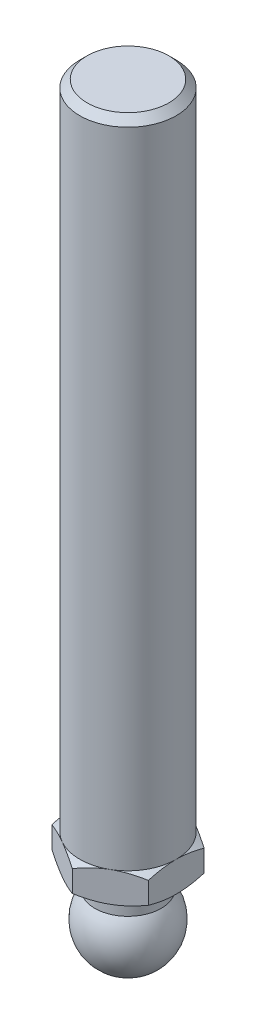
ISO-10303-21;
HEADER;
FILE_DESCRIPTION(('STEP AP214'),'2;1');
FILE_NAME('part.step','',(''),(''),'','','');
FILE_SCHEMA(('AUTOMOTIVE_DESIGN { 1 0 10303 214 1 1 1 1 }'));
ENDSEC;
DATA;
#1=APPLICATION_CONTEXT('core data for automotive mechanical design processes');
#2=APPLICATION_PROTOCOL_DEFINITION('international standard','automotive_design',2000,#1);
#3=PRODUCT_CONTEXT('',#1,'mechanical');
#4=PRODUCT('Part','Part','',(#3));
#5=PRODUCT_RELATED_PRODUCT_CATEGORY('part','',(#4));
#6=PRODUCT_DEFINITION_FORMATION('','',#4);
#7=PRODUCT_DEFINITION_CONTEXT('part definition',#1,'design');
#8=PRODUCT_DEFINITION('design','',#6,#7);
#9=PRODUCT_DEFINITION_SHAPE('','',#8);
#10=(LENGTH_UNIT() NAMED_UNIT(*) SI_UNIT(.MILLI.,.METRE.));
#11=(NAMED_UNIT(*) PLANE_ANGLE_UNIT() SI_UNIT($,.RADIAN.));
#12=(NAMED_UNIT(*) SI_UNIT($,.STERADIAN.) SOLID_ANGLE_UNIT());
#13=UNCERTAINTY_MEASURE_WITH_UNIT(LENGTH_MEASURE(1.E-05),#10,'distance_accuracy_value','');
#14=(GEOMETRIC_REPRESENTATION_CONTEXT(3) GLOBAL_UNCERTAINTY_ASSIGNED_CONTEXT((#13)) GLOBAL_UNIT_ASSIGNED_CONTEXT((#10,
#11,#12)) REPRESENTATION_CONTEXT('',''));
#15=CARTESIAN_POINT('',(0.,0.,0.));
#16=DIRECTION('',(0.,0.,1.));
#17=DIRECTION('',(1.,0.,0.));
#18=AXIS2_PLACEMENT_3D('',#15,#16,#17);
#19=CARTESIAN_POINT('',(0.,19.5,0.));
#20=DIRECTION('',(0.,-1.,0.));
#21=DIRECTION('',(0.,0.,-1.));
#22=AXIS2_PLACEMENT_3D('',#19,#20,#21);
#23=CONICAL_SURFACE('',#22,8.,1.0471975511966);
#24=CARTESIAN_POINT('',(-8.,14.714451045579,14.1889203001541));
#25=CARTESIAN_POINT('',(-8.,14.8842783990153,13.851186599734));
#26=CARTESIAN_POINT('',(-8.,15.0529801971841,13.5128811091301));
#27=CARTESIAN_POINT('',(-8.,15.3875863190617,12.8348638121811));
#28=CARTESIAN_POINT('',(-8.,15.553490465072,12.4951519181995));
#29=CARTESIAN_POINT('',(-8.,15.8822522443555,11.8134403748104));
#30=CARTESIAN_POINT('',(-8.,16.0451033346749,11.4714375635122));
#31=CARTESIAN_POINT('',(-8.,16.3666666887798,10.7854960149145));
#32=CARTESIAN_POINT('',(-8.,16.5253790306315,10.4415573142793));
#33=CARTESIAN_POINT('',(-8.,16.8449502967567,9.7353527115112));
#34=CARTESIAN_POINT('',(-8.,17.0055671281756,9.37297690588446));
#35=CARTESIAN_POINT('',(-8.,17.319773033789,8.64516064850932));
#36=CARTESIAN_POINT('',(-8.,17.4733617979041,8.27972006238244));
#37=CARTESIAN_POINT('',(-8.,17.7714937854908,7.54540420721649));
#38=CARTESIAN_POINT('',(-8.,17.9160424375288,7.17653115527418));
#39=CARTESIAN_POINT('',(-8.,18.1936308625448,6.43449862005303));
#40=CARTESIAN_POINT('',(-8.,18.3266718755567,6.06133960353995));
#41=CARTESIAN_POINT('',(-8.,18.605819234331,5.22677195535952));
#42=CARTESIAN_POINT('',(-8.,18.7482891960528,4.7641292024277));
#43=CARTESIAN_POINT('',(-8.,19.0033463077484,3.83044032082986));
#44=CARTESIAN_POINT('',(-8.,19.115935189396,3.35939468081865));
#45=CARTESIAN_POINT('',(-8.,19.2546281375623,2.65118427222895));
#46=CARTESIAN_POINT('',(-8.,19.2955954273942,2.41690742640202));
#47=CARTESIAN_POINT('',(-8.,19.3670123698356,1.94676929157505));
#48=CARTESIAN_POINT('',(-8.,19.3974635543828,1.7109082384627));
#49=CARTESIAN_POINT('',(-8.,19.4469446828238,1.23805721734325));
#50=CARTESIAN_POINT('',(-8.,19.4659782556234,1.00106763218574));
#51=CARTESIAN_POINT('',(-8.,19.4920206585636,0.526423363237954));
#52=CARTESIAN_POINT('',(-8.,19.499029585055,0.288768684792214));
#53=CARTESIAN_POINT('',(-8.,19.5007883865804,-0.188309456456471));
#54=CARTESIAN_POINT('',(-8.,19.4954490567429,-0.427733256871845));
#55=CARTESIAN_POINT('',(-8.,19.4725128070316,-0.905988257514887));
#56=CARTESIAN_POINT('',(-8.,19.4549157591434,-1.14481945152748));
#57=CARTESIAN_POINT('',(-8.,19.4080408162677,-1.6214163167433));
#58=CARTESIAN_POINT('',(-8.,19.3787584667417,-1.85918154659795));
#59=CARTESIAN_POINT('',(-8.,19.3094074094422,-2.33311174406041));
#60=CARTESIAN_POINT('',(-8.,19.2693385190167,-2.56927668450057));
#61=CARTESIAN_POINT('',(-8.,19.1329562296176,-3.28330816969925));
#62=CARTESIAN_POINT('',(-8.,19.0213579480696,-3.75830022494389));
#63=CARTESIAN_POINT('',(-8.,18.830875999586,-4.46428489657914));
#64=CARTESIAN_POINT('',(-8.,18.7635265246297,-4.69855285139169));
#65=CARTESIAN_POINT('',(-8.,18.6221775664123,-5.16507806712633));
#66=CARTESIAN_POINT('',(-8.,18.5481783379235,-5.39733540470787));
#67=CARTESIAN_POINT('',(-8.,18.345623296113,-6.00705809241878));
#68=CARTESIAN_POINT('',(-8.,18.2123002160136,-6.38293491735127));
#69=CARTESIAN_POINT('',(-8.,17.9338794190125,-7.13030495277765));
#70=CARTESIAN_POINT('',(-8.,17.7887803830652,-7.50179766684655));
#71=CARTESIAN_POINT('',(-8.,17.4893388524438,-8.2412884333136));
#72=CARTESIAN_POINT('',(-8.,17.3349906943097,-8.60928418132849));
#73=CARTESIAN_POINT('',(-8.,17.0191219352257,-9.34215095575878));
#74=CARTESIAN_POINT('',(-8.,16.8576016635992,-9.70702212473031));
#75=CARTESIAN_POINT('',(-8.,16.5362228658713,-10.4179250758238));
#76=CARTESIAN_POINT('',(-8.,16.3766130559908,-10.7640696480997));
#77=CARTESIAN_POINT('',(-8.,16.0531867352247,-11.4543922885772));
#78=CARTESIAN_POINT('',(-8.,15.8893701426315,-11.7985703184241));
#79=CARTESIAN_POINT('',(-8.,15.558638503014,-12.4845836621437));
#80=CARTESIAN_POINT('',(-8.,15.3917303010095,-12.8264222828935));
#81=CARTESIAN_POINT('',(-8.,15.0550779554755,-13.5086735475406));
#82=CARTESIAN_POINT('',(-8.,14.8853339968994,-13.8490862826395));
#83=CARTESIAN_POINT('',(-8.,14.714451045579,-14.1889203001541));
#84=B_SPLINE_CURVE_WITH_KNOTS('',3,(#24,#25,#26,#27,#28,#29,#30,#31,#32,#33,#34,#35,#36,#37,#38,
#39,#40,#41,#42,#43,#44,#45,#46,#47,#48,#49,#50,#51,#52,#53,#54,#55,#56,#57,#58,#59,#60,#61,#62,
#63,#64,#65,#66,#67,#68,#69,#70,#71,#72,#73,#74,#75,#76,#77,#78,#79,#80,#81,#82,#83),
.UNSPECIFIED.,.F.,.F.,(4,2,2,2,2,2,2,2,2,2,2,2,2,2,2,2,2,2,2,2,2,2,2,2,2,2,2,2,2,4),(0.,
1.13409047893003,2.2682527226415,3.40461779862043,4.54096142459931,5.73003075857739,
6.91915250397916,8.1075531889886,9.29582565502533,10.7473798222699,12.1988498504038,
12.9121466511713,13.6253394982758,14.3383055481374,15.0512658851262,15.7693927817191,
16.4875271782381,17.2059355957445,17.9243561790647,19.38648697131,20.1177019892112,
20.8488890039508,22.0450800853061,23.2414053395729,24.4384707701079,25.6354812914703,
26.7789606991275,27.9224623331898,29.063679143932,30.2048218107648),.UNSPECIFIED.);
#85=CARTESIAN_POINT('',(-8.,18.7854688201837,4.61880215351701));
#86=VERTEX_POINT('',#85);
#87=CARTESIAN_POINT('',(-8.,19.5,0.));
#88=VERTEX_POINT('',#87);
#89=EDGE_CURVE('E313',#86,#88,#84,.T.);
#90=ORIENTED_EDGE('',*,*,#89,.F.);
#91=CARTESIAN_POINT('',(0.0002,18.7854021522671,9.23771977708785));
#92=CARTESIAN_POINT('',(-0.175648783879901,18.8440092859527,9.13619343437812));
#93=CARTESIAN_POINT('',(-0.352153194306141,18.8999565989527,9.03428856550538));
#94=CARTESIAN_POINT('',(-0.706595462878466,19.0057989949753,8.82965122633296));
#95=CARTESIAN_POINT('',(-0.884533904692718,19.0556914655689,8.72691841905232));
#96=CARTESIAN_POINT('',(-1.42119823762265,19.1953072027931,8.41707512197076));
#97=CARTESIAN_POINT('',(-1.78204258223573,19.2747188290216,8.20874154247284));
#98=CARTESIAN_POINT('',(-2.32203917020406,19.3678383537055,7.89697436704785));
#99=CARTESIAN_POINT('',(-2.49957818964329,19.3943654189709,7.79447216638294));
#100=CARTESIAN_POINT('',(-2.85545911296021,19.4388468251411,7.58900421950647));
#101=CARTESIAN_POINT('',(-3.03380094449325,19.4568019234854,7.4860385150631));
#102=CARTESIAN_POINT('',(-3.3907916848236,19.4836843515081,7.27992981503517));
#103=CARTESIAN_POINT('',(-3.56944001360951,19.4926219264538,7.17678715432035));
#104=CARTESIAN_POINT('',(-3.92690170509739,19.5012776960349,6.97040655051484));
#105=CARTESIAN_POINT('',(-4.10571506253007,19.5009961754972,6.86716861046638));
#106=CARTESIAN_POINT('',(-4.44001336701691,19.4918549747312,6.67416139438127));
#107=CARTESIAN_POINT('',(-4.59552190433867,19.4841103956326,6.58437849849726));
#108=CARTESIAN_POINT('',(-4.90617476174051,19.4617988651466,6.40502298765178));
#109=CARTESIAN_POINT('',(-5.06131905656,19.4472314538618,6.31545038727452));
#110=CARTESIAN_POINT('',(-5.52615131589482,19.3936393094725,6.04707935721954));
#111=CARTESIAN_POINT('',(-5.83501648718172,19.3447313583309,5.86875596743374));
#112=CARTESIAN_POINT('',(-6.4560232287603,19.2224605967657,5.51021755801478));
#113=CARTESIAN_POINT('',(-6.76808554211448,19.148579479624,5.33004829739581));
#114=CARTESIAN_POINT('',(-7.38755648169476,18.980899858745,4.97239658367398));
#115=CARTESIAN_POINT('',(-7.69497304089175,18.8871407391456,4.79490955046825));
#116=CARTESIAN_POINT('',(-8.0002,18.7854021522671,4.61868668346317));
#117=B_SPLINE_CURVE_WITH_KNOTS('',3,(#91,#92,#93,#94,#95,#96,#97,#98,#99,#100,#101,#102,#103,
#104,#105,#106,#107,#108,#109,#110,#111,#112,#113,#114,#115,#116),.UNSPECIFIED.,.F.,.F.,(4,2,2,
2,2,2,2,2,2,2,2,2,4),(0.,0.633973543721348,1.26821965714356,2.53934712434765,3.15934343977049,
3.77928496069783,4.39852133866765,5.01773858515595,5.55680239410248,6.09590254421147,
7.17487077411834,8.27776850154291,9.37850115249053),.UNSPECIFIED.);
#118=CARTESIAN_POINT('',(-4.,19.5,6.92820323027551));
#119=VERTEX_POINT('',#118);
#120=EDGE_CURVE('E138',#119,#86,#117,.T.);
#121=ORIENTED_EDGE('',*,*,#120,.F.);
#122=CARTESIAN_POINT('',(0.,19.5,0.));
#123=DIRECTION('',(0.,-1.,0.));
#124=DIRECTION('',(0.,0.,-1.));
#125=AXIS2_PLACEMENT_3D('',#122,#123,#124);
#126=CIRCLE('',#125,8.);
#127=EDGE_CURVE('E286',#119,#88,#126,.T.);
#128=ORIENTED_EDGE('',*,*,#127,.T.);
#129=EDGE_LOOP('',(#90,#121,#128));
#130=FACE_BOUND('',#129,.T.);
#131=ADVANCED_FACE('F17',(#130),#23,.T.);
#132=CARTESIAN_POINT('',(-8.,18.7854688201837,-4.61880215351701));
#133=VERTEX_POINT('',#132);
#134=EDGE_CURVE('E196',#88,#133,#84,.T.);
#135=ORIENTED_EDGE('',*,*,#134,.F.);
#136=CARTESIAN_POINT('',(-4.,19.5,-6.92820323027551));
#137=VERTEX_POINT('',#136);
#138=EDGE_CURVE('E198',#88,#137,#126,.T.);
#139=ORIENTED_EDGE('',*,*,#138,.T.);
#140=CARTESIAN_POINT('',(-8.0002,18.7854021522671,-4.61868668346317));
#141=CARTESIAN_POINT('',(-7.8243512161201,18.8440092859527,-4.7202130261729));
#142=CARTESIAN_POINT('',(-7.64784680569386,18.8999565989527,-4.82211789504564));
#143=CARTESIAN_POINT('',(-7.29340453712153,19.0057989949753,-5.02675523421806));
#144=CARTESIAN_POINT('',(-7.11546609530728,19.0556914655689,-5.1294880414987));
#145=CARTESIAN_POINT('',(-6.57880176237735,19.1953072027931,-5.43933133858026));
#146=CARTESIAN_POINT('',(-6.21795741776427,19.2747188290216,-5.64766491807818));
#147=CARTESIAN_POINT('',(-5.67796082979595,19.3678383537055,-5.95943209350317));
#148=CARTESIAN_POINT('',(-5.50042181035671,19.3943654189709,-6.06193429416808));
#149=CARTESIAN_POINT('',(-5.1445408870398,19.4388468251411,-6.26740224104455));
#150=CARTESIAN_POINT('',(-4.96619905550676,19.4568019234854,-6.37036794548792));
#151=CARTESIAN_POINT('',(-4.6092083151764,19.4836843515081,-6.57647664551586));
#152=CARTESIAN_POINT('',(-4.43055998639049,19.4926219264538,-6.67961930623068));
#153=CARTESIAN_POINT('',(-4.07309829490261,19.5012776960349,-6.88599991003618));
#154=CARTESIAN_POINT('',(-3.89428493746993,19.5009961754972,-6.98923785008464));
#155=CARTESIAN_POINT('',(-3.55998663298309,19.4918549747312,-7.18224506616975));
#156=CARTESIAN_POINT('',(-3.40447809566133,19.4841103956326,-7.27202796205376));
#157=CARTESIAN_POINT('',(-3.09382523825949,19.4617988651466,-7.45138347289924));
#158=CARTESIAN_POINT('',(-2.93868094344,19.4472314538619,-7.5409560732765));
#159=CARTESIAN_POINT('',(-2.47384868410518,19.3936393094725,-7.80932710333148));
#160=CARTESIAN_POINT('',(-2.16498351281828,19.3447313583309,-7.98765049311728));
#161=CARTESIAN_POINT('',(-1.5439767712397,19.2224605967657,-8.34618890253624));
#162=CARTESIAN_POINT('',(-1.23191445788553,19.148579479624,-8.52635816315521));
#163=CARTESIAN_POINT('',(-0.612443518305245,18.980899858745,-8.88400987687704));
#164=CARTESIAN_POINT('',(-0.305026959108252,18.8871407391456,-9.06149691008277));
#165=CARTESIAN_POINT('',(0.000200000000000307,18.7854021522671,-9.23771977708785));
#166=B_SPLINE_CURVE_WITH_KNOTS('',3,(#140,#141,#142,#143,#144,#145,#146,#147,#148,#149,#150,
#151,#152,#153,#154,#155,#156,#157,#158,#159,#160,#161,#162,#163,#164,#165),.UNSPECIFIED.,.F.,
.F.,(4,2,2,2,2,2,2,2,2,2,2,2,4),(0.,0.63397354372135,1.26821965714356,2.53934712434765,
3.15934343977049,3.77928496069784,4.39852133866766,5.01773858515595,5.55680239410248,
6.09590254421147,7.17487077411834,8.27776850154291,9.37850115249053),.UNSPECIFIED.);
#167=EDGE_CURVE('E186',#133,#137,#166,.T.);
#168=ORIENTED_EDGE('',*,*,#167,.F.);
#169=EDGE_LOOP('',(#135,#139,#168));
#170=FACE_BOUND('',#169,.T.);
#171=ADVANCED_FACE('F195',(#170),#23,.T.);
#172=CARTESIAN_POINT('',(0.,18.7854688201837,-9.23760430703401));
#173=VERTEX_POINT('',#172);
#174=EDGE_CURVE('E200',#137,#173,#166,.T.);
#175=ORIENTED_EDGE('',*,*,#174,.F.);
#176=CARTESIAN_POINT('',(4.,19.5,-6.92820323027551));
#177=VERTEX_POINT('',#176);
#178=EDGE_CURVE('E293',#137,#177,#126,.T.);
#179=ORIENTED_EDGE('',*,*,#178,.T.);
#180=CARTESIAN_POINT('',(-0.0002,18.7854021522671,-9.23771977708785));
#181=CARTESIAN_POINT('',(0.175648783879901,18.8440092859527,-9.13619343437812));
#182=CARTESIAN_POINT('',(0.352153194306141,18.8999565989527,-9.03428856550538));
#183=CARTESIAN_POINT('',(0.706595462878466,19.0057989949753,-8.82965122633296));
#184=CARTESIAN_POINT('',(0.884533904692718,19.0556914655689,-8.72691841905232));
#185=CARTESIAN_POINT('',(1.42119823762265,19.1953072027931,-8.41707512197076));
#186=CARTESIAN_POINT('',(1.78204258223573,19.2747188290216,-8.20874154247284));
#187=CARTESIAN_POINT('',(2.32203917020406,19.3678383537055,-7.89697436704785));
#188=CARTESIAN_POINT('',(2.49957818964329,19.3943654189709,-7.79447216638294));
#189=CARTESIAN_POINT('',(2.85545911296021,19.4388468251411,-7.58900421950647));
#190=CARTESIAN_POINT('',(3.03380094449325,19.4568019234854,-7.4860385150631));
#191=CARTESIAN_POINT('',(3.3907916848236,19.4836843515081,-7.27992981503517));
#192=CARTESIAN_POINT('',(3.56944001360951,19.4926219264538,-7.17678715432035));
#193=CARTESIAN_POINT('',(3.92690170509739,19.5012776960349,-6.97040655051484));
#194=CARTESIAN_POINT('',(4.10571506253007,19.5009961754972,-6.86716861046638));
#195=CARTESIAN_POINT('',(4.44001336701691,19.4918549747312,-6.67416139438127));
#196=CARTESIAN_POINT('',(4.59552190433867,19.4841103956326,-6.58437849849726));
#197=CARTESIAN_POINT('',(4.90617476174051,19.4617988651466,-6.40502298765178));
#198=CARTESIAN_POINT('',(5.06131905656,19.4472314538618,-6.31545038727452));
#199=CARTESIAN_POINT('',(5.52615131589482,19.3936393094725,-6.04707935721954));
#200=CARTESIAN_POINT('',(5.83501648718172,19.3447313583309,-5.86875596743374));
#201=CARTESIAN_POINT('',(6.4560232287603,19.2224605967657,-5.51021755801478));
#202=CARTESIAN_POINT('',(6.76808554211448,19.148579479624,-5.33004829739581));
#203=CARTESIAN_POINT('',(7.38755648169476,18.980899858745,-4.97239658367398));
#204=CARTESIAN_POINT('',(7.69497304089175,18.8871407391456,-4.79490955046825));
#205=CARTESIAN_POINT('',(8.0002,18.7854021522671,-4.61868668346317));
#206=B_SPLINE_CURVE_WITH_KNOTS('',3,(#180,#181,#182,#183,#184,#185,#186,#187,#188,#189,#190,
#191,#192,#193,#194,#195,#196,#197,#198,#199,#200,#201,#202,#203,#204,#205),.UNSPECIFIED.,.F.,
.F.,(4,2,2,2,2,2,2,2,2,2,2,2,4),(0.,0.633973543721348,1.26821965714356,2.53934712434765,
3.15934343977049,3.77928496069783,4.39852133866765,5.01773858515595,5.55680239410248,
6.09590254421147,7.17487077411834,8.27776850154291,9.37850115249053),.UNSPECIFIED.);
#207=EDGE_CURVE('E246',#173,#177,#206,.T.);
#208=ORIENTED_EDGE('',*,*,#207,.F.);
#209=EDGE_LOOP('',(#175,#179,#208));
#210=FACE_BOUND('',#209,.T.);
#211=ADVANCED_FACE('F345',(#210),#23,.T.);
#212=CARTESIAN_POINT('',(8.,18.7854688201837,-4.61880215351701));
#213=VERTEX_POINT('',#212);
#214=EDGE_CURVE('E241',#177,#213,#206,.T.);
#215=ORIENTED_EDGE('',*,*,#214,.F.);
#216=CARTESIAN_POINT('',(8.,19.5,0.));
#217=VERTEX_POINT('',#216);
#218=EDGE_CURVE('E290',#177,#217,#126,.T.);
#219=ORIENTED_EDGE('',*,*,#218,.T.);
#220=CARTESIAN_POINT('',(8.,14.714451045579,-14.1889203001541));
#221=CARTESIAN_POINT('',(8.,14.8842783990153,-13.851186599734));
#222=CARTESIAN_POINT('',(8.,15.0529801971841,-13.5128811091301));
#223=CARTESIAN_POINT('',(8.,15.3875863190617,-12.8348638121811));
#224=CARTESIAN_POINT('',(8.,15.553490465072,-12.4951519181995));
#225=CARTESIAN_POINT('',(8.,15.8822522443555,-11.8134403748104));
#226=CARTESIAN_POINT('',(8.,16.0451033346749,-11.4714375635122));
#227=CARTESIAN_POINT('',(8.,16.3666666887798,-10.7854960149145));
#228=CARTESIAN_POINT('',(8.,16.5253790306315,-10.4415573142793));
#229=CARTESIAN_POINT('',(8.,16.8449502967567,-9.7353527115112));
#230=CARTESIAN_POINT('',(8.,17.0055671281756,-9.37297690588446));
#231=CARTESIAN_POINT('',(8.,17.319773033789,-8.64516064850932));
#232=CARTESIAN_POINT('',(8.,17.4733617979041,-8.27972006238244));
#233=CARTESIAN_POINT('',(8.,17.7714937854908,-7.54540420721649));
#234=CARTESIAN_POINT('',(8.,17.9160424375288,-7.17653115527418));
#235=CARTESIAN_POINT('',(8.,18.1936308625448,-6.43449862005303));
#236=CARTESIAN_POINT('',(8.,18.3266718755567,-6.06133960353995));
#237=CARTESIAN_POINT('',(8.,18.605819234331,-5.22677195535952));
#238=CARTESIAN_POINT('',(8.,18.7482891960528,-4.7641292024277));
#239=CARTESIAN_POINT('',(8.,19.0033463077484,-3.83044032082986));
#240=CARTESIAN_POINT('',(8.,19.115935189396,-3.35939468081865));
#241=CARTESIAN_POINT('',(8.,19.2546281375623,-2.65118427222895));
#242=CARTESIAN_POINT('',(8.,19.2955954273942,-2.41690742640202));
#243=CARTESIAN_POINT('',(8.,19.3670123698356,-1.94676929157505));
#244=CARTESIAN_POINT('',(8.,19.3974635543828,-1.7109082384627));
#245=CARTESIAN_POINT('',(8.,19.4469446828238,-1.23805721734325));
#246=CARTESIAN_POINT('',(8.,19.4659782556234,-1.00106763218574));
#247=CARTESIAN_POINT('',(8.,19.4920206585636,-0.526423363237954));
#248=CARTESIAN_POINT('',(8.,19.499029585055,-0.288768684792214));
#249=CARTESIAN_POINT('',(8.,19.5007883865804,0.188309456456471));
#250=CARTESIAN_POINT('',(8.,19.4954490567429,0.427733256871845));
#251=CARTESIAN_POINT('',(8.,19.4725128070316,0.905988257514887));
#252=CARTESIAN_POINT('',(8.,19.4549157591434,1.14481945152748));
#253=CARTESIAN_POINT('',(8.,19.4080408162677,1.6214163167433));
#254=CARTESIAN_POINT('',(8.,19.3787584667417,1.85918154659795));
#255=CARTESIAN_POINT('',(8.,19.3094074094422,2.33311174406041));
#256=CARTESIAN_POINT('',(8.,19.2693385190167,2.56927668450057));
#257=CARTESIAN_POINT('',(8.,19.1329562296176,3.28330816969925));
#258=CARTESIAN_POINT('',(8.,19.0213579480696,3.75830022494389));
#259=CARTESIAN_POINT('',(8.,18.830875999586,4.46428489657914));
#260=CARTESIAN_POINT('',(8.,18.7635265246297,4.69855285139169));
#261=CARTESIAN_POINT('',(8.,18.6221775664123,5.16507806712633));
#262=CARTESIAN_POINT('',(8.,18.5481783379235,5.39733540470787));
#263=CARTESIAN_POINT('',(8.,18.345623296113,6.00705809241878));
#264=CARTESIAN_POINT('',(8.,18.2123002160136,6.38293491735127));
#265=CARTESIAN_POINT('',(8.,17.9338794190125,7.13030495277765));
#266=CARTESIAN_POINT('',(8.,17.7887803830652,7.50179766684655));
#267=CARTESIAN_POINT('',(8.,17.4893388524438,8.2412884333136));
#268=CARTESIAN_POINT('',(8.,17.3349906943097,8.60928418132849));
#269=CARTESIAN_POINT('',(8.,17.0191219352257,9.34215095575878));
#270=CARTESIAN_POINT('',(8.,16.8576016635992,9.70702212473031));
#271=CARTESIAN_POINT('',(8.,16.5362228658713,10.4179250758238));
#272=CARTESIAN_POINT('',(8.,16.3766130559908,10.7640696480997));
#273=CARTESIAN_POINT('',(8.,16.0531867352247,11.4543922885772));
#274=CARTESIAN_POINT('',(8.,15.8893701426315,11.7985703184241));
#275=CARTESIAN_POINT('',(8.,15.558638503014,12.4845836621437));
#276=CARTESIAN_POINT('',(8.,15.3917303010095,12.8264222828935));
#277=CARTESIAN_POINT('',(8.,15.0550779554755,13.5086735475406));
#278=CARTESIAN_POINT('',(8.,14.8853339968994,13.8490862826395));
#279=CARTESIAN_POINT('',(8.,14.714451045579,14.1889203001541));
#280=B_SPLINE_CURVE_WITH_KNOTS('',3,(#220,#221,#222,#223,#224,#225,#226,#227,#228,#229,#230,
#231,#232,#233,#234,#235,#236,#237,#238,#239,#240,#241,#242,#243,#244,#245,#246,#247,#248,#249,
#250,#251,#252,#253,#254,#255,#256,#257,#258,#259,#260,#261,#262,#263,#264,#265,#266,#267,#268,
#269,#270,#271,#272,#273,#274,#275,#276,#277,#278,#279),.UNSPECIFIED.,.F.,.F.,(4,2,2,2,2,2,2,2,
2,2,2,2,2,2,2,2,2,2,2,2,2,2,2,2,2,2,2,2,2,4),(0.,1.13409047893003,2.2682527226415,
3.40461779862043,4.54096142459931,5.73003075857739,6.91915250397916,8.1075531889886,
9.29582565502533,10.7473798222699,12.1988498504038,12.9121466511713,13.6253394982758,
14.3383055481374,15.0512658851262,15.7693927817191,16.4875271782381,17.2059355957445,
17.9243561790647,19.38648697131,20.1177019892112,20.8488890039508,22.0450800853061,
23.2414053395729,24.4384707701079,25.6354812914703,26.7789606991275,27.9224623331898,
29.063679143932,30.2048218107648),.UNSPECIFIED.);
#281=EDGE_CURVE('E252',#213,#217,#280,.T.);
#282=ORIENTED_EDGE('',*,*,#281,.F.);
#283=EDGE_LOOP('',(#215,#219,#282));
#284=FACE_BOUND('',#283,.T.);
#285=ADVANCED_FACE('F355',(#284),#23,.T.);
#286=CARTESIAN_POINT('',(8.,18.7854688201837,4.61880215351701));
#287=VERTEX_POINT('',#286);
#288=EDGE_CURVE('E254',#217,#287,#280,.T.);
#289=ORIENTED_EDGE('',*,*,#288,.F.);
#290=CARTESIAN_POINT('',(4.,19.5,6.92820323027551));
#291=VERTEX_POINT('',#290);
#292=EDGE_CURVE('E284',#217,#291,#126,.T.);
#293=ORIENTED_EDGE('',*,*,#292,.T.);
#294=CARTESIAN_POINT('',(8.0002,18.7854021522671,4.61868668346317));
#295=CARTESIAN_POINT('',(7.8243512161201,18.8440092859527,4.7202130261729));
#296=CARTESIAN_POINT('',(7.64784680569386,18.8999565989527,4.82211789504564));
#297=CARTESIAN_POINT('',(7.29340453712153,19.0057989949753,5.02675523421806));
#298=CARTESIAN_POINT('',(7.11546609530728,19.0556914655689,5.1294880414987));
#299=CARTESIAN_POINT('',(6.57880176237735,19.1953072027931,5.43933133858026));
#300=CARTESIAN_POINT('',(6.21795741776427,19.2747188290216,5.64766491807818));
#301=CARTESIAN_POINT('',(5.67796082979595,19.3678383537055,5.95943209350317));
#302=CARTESIAN_POINT('',(5.50042181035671,19.3943654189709,6.06193429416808));
#303=CARTESIAN_POINT('',(5.1445408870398,19.4388468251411,6.26740224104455));
#304=CARTESIAN_POINT('',(4.96619905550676,19.4568019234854,6.37036794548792));
#305=CARTESIAN_POINT('',(4.6092083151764,19.4836843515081,6.57647664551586));
#306=CARTESIAN_POINT('',(4.43055998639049,19.4926219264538,6.67961930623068));
#307=CARTESIAN_POINT('',(4.07309829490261,19.5012776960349,6.88599991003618));
#308=CARTESIAN_POINT('',(3.89428493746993,19.5009961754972,6.98923785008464));
#309=CARTESIAN_POINT('',(3.55998663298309,19.4918549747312,7.18224506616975));
#310=CARTESIAN_POINT('',(3.40447809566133,19.4841103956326,7.27202796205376));
#311=CARTESIAN_POINT('',(3.09382523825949,19.4617988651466,7.45138347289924));
#312=CARTESIAN_POINT('',(2.93868094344,19.4472314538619,7.5409560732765));
#313=CARTESIAN_POINT('',(2.47384868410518,19.3936393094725,7.80932710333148));
#314=CARTESIAN_POINT('',(2.16498351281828,19.3447313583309,7.98765049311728));
#315=CARTESIAN_POINT('',(1.5439767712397,19.2224605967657,8.34618890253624));
#316=CARTESIAN_POINT('',(1.23191445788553,19.148579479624,8.52635816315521));
#317=CARTESIAN_POINT('',(0.612443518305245,18.980899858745,8.88400987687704));
#318=CARTESIAN_POINT('',(0.305026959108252,18.8871407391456,9.06149691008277));
#319=CARTESIAN_POINT('',(-0.000200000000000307,18.7854021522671,9.23771977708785));
#320=B_SPLINE_CURVE_WITH_KNOTS('',3,(#294,#295,#296,#297,#298,#299,#300,#301,#302,#303,#304,
#305,#306,#307,#308,#309,#310,#311,#312,#313,#314,#315,#316,#317,#318,#319),.UNSPECIFIED.,.F.,
.F.,(4,2,2,2,2,2,2,2,2,2,2,2,4),(0.,0.63397354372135,1.26821965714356,2.53934712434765,
3.15934343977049,3.77928496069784,4.39852133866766,5.01773858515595,5.55680239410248,
6.09590254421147,7.17487077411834,8.27776850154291,9.37850115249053),.UNSPECIFIED.);
#321=EDGE_CURVE('E129',#287,#291,#320,.T.);
#322=ORIENTED_EDGE('',*,*,#321,.F.);
#323=EDGE_LOOP('',(#289,#293,#322));
#324=FACE_BOUND('',#323,.T.);
#325=ADVANCED_FACE('F288',(#324),#23,.T.);
#326=CARTESIAN_POINT('',(0.,18.7854688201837,9.23760430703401));
#327=VERTEX_POINT('',#326);
#328=EDGE_CURVE('E119',#291,#327,#320,.T.);
#329=ORIENTED_EDGE('',*,*,#328,.F.);
#330=EDGE_CURVE('E277',#291,#119,#126,.T.);
#331=ORIENTED_EDGE('',*,*,#330,.T.);
#332=EDGE_CURVE('E32',#327,#119,#117,.T.);
#333=ORIENTED_EDGE('',*,*,#332,.F.);
#334=EDGE_LOOP('',(#329,#331,#333));
#335=FACE_BOUND('',#334,.T.);
#336=ADVANCED_FACE('F276',(#335),#23,.T.);
#337=CARTESIAN_POINT('',(0.,127.5,0.));
#338=DIRECTION('',(0.,-1.,0.));
#339=DIRECTION('',(0.,0.,-1.));
#340=AXIS2_PLACEMENT_3D('',#337,#338,#339);
#341=PLANE('',#340);
#342=CARTESIAN_POINT('',(0.,127.5,0.));
#343=DIRECTION('',(0.,-1.,0.));
#344=DIRECTION('',(0.,0.,-1.));
#345=AXIS2_PLACEMENT_3D('',#342,#343,#344);
#346=CIRCLE('',#345,6.773);
#347=CARTESIAN_POINT('',(0.,127.5,-6.773));
#348=VERTEX_POINT('',#347);
#349=EDGE_CURVE('E11',#348,#348,#346,.T.);
#350=ORIENTED_EDGE('',*,*,#349,.F.);
#351=EDGE_LOOP('',(#350));
#352=FACE_BOUND('',#351,.T.);
#353=ADVANCED_FACE('F19',(#352),#341,.F.);
#354=CARTESIAN_POINT('',(0.,127.5,0.));
#355=DIRECTION('',(0.,-1.,0.));
#356=DIRECTION('',(0.,0.,-1.));
#357=AXIS2_PLACEMENT_3D('',#354,#355,#356);
#358=CONICAL_SURFACE('',#357,6.773,0.785398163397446);
#359=CARTESIAN_POINT('',(0.,126.273,0.));
#360=DIRECTION('',(0.,-1.,0.));
#361=DIRECTION('',(0.,0.,-1.));
#362=AXIS2_PLACEMENT_3D('',#359,#360,#361);
#363=CIRCLE('',#362,8.);
#364=CARTESIAN_POINT('',(0.,126.273,-8.));
#365=VERTEX_POINT('',#364);
#366=EDGE_CURVE('E25',#365,#365,#363,.T.);
#367=ORIENTED_EDGE('',*,*,#366,.F.);
#368=EDGE_LOOP('',(#367));
#369=FACE_BOUND('',#368,.T.);
#370=ORIENTED_EDGE('',*,*,#349,.T.);
#371=EDGE_LOOP('',(#370));
#372=FACE_BOUND('',#371,.T.);
#373=ADVANCED_FACE('F353',(#369,#372),#358,.T.);
#374=CARTESIAN_POINT('',(0.,0.,0.));
#375=DIRECTION('',(0.,-1.,0.));
#376=DIRECTION('',(0.,0.,-1.));
#377=AXIS2_PLACEMENT_3D('',#374,#375,#376);
#378=CYLINDRICAL_SURFACE('',#377,8.);
#379=ORIENTED_EDGE('',*,*,#292,.F.);
#380=ORIENTED_EDGE('',*,*,#218,.F.);
#381=ORIENTED_EDGE('',*,*,#178,.F.);
#382=ORIENTED_EDGE('',*,*,#138,.F.);
#383=ORIENTED_EDGE('',*,*,#127,.F.);
#384=ORIENTED_EDGE('',*,*,#330,.F.);
#385=EDGE_LOOP('',(#379,#380,#381,#382,#383,#384));
#386=FACE_BOUND('',#385,.T.);
#387=ORIENTED_EDGE('',*,*,#366,.T.);
#388=EDGE_LOOP('',(#387));
#389=FACE_BOUND('',#388,.T.);
#390=ADVANCED_FACE('F281',(#386,#389),#378,.T.);
#391=CARTESIAN_POINT('',(-8.,14.3,-4.61880215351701));
#392=DIRECTION('',(-1.,0.,0.));
#393=DIRECTION('',(0.,0.,1.));
#394=AXIS2_PLACEMENT_3D('',#391,#392,#393);
#395=PLANE('',#394);
#396=ORIENTED_EDGE('',*,*,#89,.T.);
#397=ORIENTED_EDGE('',*,*,#134,.T.);
#398=DIRECTION('',(0.,1.,0.));
#399=VECTOR('',#398,1.);
#400=CARTESIAN_POINT('',(-8.,14.3,-4.61880215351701));
#401=LINE('',#400,#399);
#402=CARTESIAN_POINT('',(-8.,15.2145311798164,-4.61880215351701));
#403=VERTEX_POINT('',#402);
#404=EDGE_CURVE('E112',#403,#133,#401,.T.);
#405=ORIENTED_EDGE('',*,*,#404,.F.);
#406=CARTESIAN_POINT('',(-8.,19.285548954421,-14.1889203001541));
#407=CARTESIAN_POINT('',(-8.,19.1157216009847,-13.851186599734));
#408=CARTESIAN_POINT('',(-8.,18.9470198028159,-13.5128811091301));
#409=CARTESIAN_POINT('',(-8.,18.6124136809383,-12.8348638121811));
#410=CARTESIAN_POINT('',(-8.,18.446509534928,-12.4951519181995));
#411=CARTESIAN_POINT('',(-8.,18.1177477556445,-11.8134403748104));
#412=CARTESIAN_POINT('',(-8.,17.9548966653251,-11.4714375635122));
#413=CARTESIAN_POINT('',(-8.,17.6333333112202,-10.7854960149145));
#414=CARTESIAN_POINT('',(-8.,17.4746209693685,-10.4415573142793));
#415=CARTESIAN_POINT('',(-8.,17.1550497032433,-9.7353527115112));
#416=CARTESIAN_POINT('',(-8.,16.9944328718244,-9.37297690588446));
#417=CARTESIAN_POINT('',(-8.,16.680226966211,-8.64516064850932));
#418=CARTESIAN_POINT('',(-8.,16.5266382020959,-8.27972006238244));
#419=CARTESIAN_POINT('',(-8.,16.2285062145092,-7.54540420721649));
#420=CARTESIAN_POINT('',(-8.,16.0839575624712,-7.17653115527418));
#421=CARTESIAN_POINT('',(-8.,15.8063691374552,-6.43449862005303));
#422=CARTESIAN_POINT('',(-8.,15.6733281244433,-6.06133960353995));
#423=CARTESIAN_POINT('',(-8.,15.394180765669,-5.22677195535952));
#424=CARTESIAN_POINT('',(-8.,15.2517108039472,-4.7641292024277));
#425=CARTESIAN_POINT('',(-8.,14.9966536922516,-3.83044032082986));
#426=CARTESIAN_POINT('',(-8.,14.884064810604,-3.35939468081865));
#427=CARTESIAN_POINT('',(-8.,14.7453718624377,-2.65118427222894));
#428=CARTESIAN_POINT('',(-8.,14.7044045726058,-2.41690742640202));
#429=CARTESIAN_POINT('',(-8.,14.6329876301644,-1.94676929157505));
#430=CARTESIAN_POINT('',(-8.,14.6025364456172,-1.7109082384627));
#431=CARTESIAN_POINT('',(-8.,14.5530553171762,-1.23805721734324));
#432=CARTESIAN_POINT('',(-8.,14.5340217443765,-1.00106763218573));
#433=CARTESIAN_POINT('',(-8.,14.5079793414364,-0.52642336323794));
#434=CARTESIAN_POINT('',(-8.,14.500970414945,-0.288768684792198));
#435=CARTESIAN_POINT('',(-8.,14.4992116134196,0.188309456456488));
#436=CARTESIAN_POINT('',(-8.,14.5045509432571,0.427733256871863));
#437=CARTESIAN_POINT('',(-8.,14.5274871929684,0.905988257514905));
#438=CARTESIAN_POINT('',(-8.,14.5450842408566,1.1448194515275));
#439=CARTESIAN_POINT('',(-8.,14.5919591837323,1.62141631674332));
#440=CARTESIAN_POINT('',(-8.,14.6212415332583,1.85918154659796));
#441=CARTESIAN_POINT('',(-8.,14.6905925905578,2.33311174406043));
#442=CARTESIAN_POINT('',(-8.,14.7306614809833,2.56927668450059));
#443=CARTESIAN_POINT('',(-8.,14.8670437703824,3.28330816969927));
#444=CARTESIAN_POINT('',(-8.,14.9786420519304,3.75830022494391));
#445=CARTESIAN_POINT('',(-8.,15.169124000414,4.46428489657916));
#446=CARTESIAN_POINT('',(-8.,15.2364734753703,4.69855285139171));
#447=CARTESIAN_POINT('',(-8.,15.3778224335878,5.16507806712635));
#448=CARTESIAN_POINT('',(-8.,15.4518216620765,5.3973354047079));
#449=CARTESIAN_POINT('',(-8.,15.654376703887,6.0070580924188));
#450=CARTESIAN_POINT('',(-8.,15.7876997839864,6.38293491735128));
#451=CARTESIAN_POINT('',(-8.,16.0661205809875,7.13030495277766));
#452=CARTESIAN_POINT('',(-8.,16.2112196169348,7.50179766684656));
#453=CARTESIAN_POINT('',(-8.,16.5106611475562,8.2412884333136));
#454=CARTESIAN_POINT('',(-8.,16.6650093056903,8.60928418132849));
#455=CARTESIAN_POINT('',(-8.,16.9808780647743,9.34215095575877));
#456=CARTESIAN_POINT('',(-8.,17.1423983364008,9.7070221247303));
#457=CARTESIAN_POINT('',(-8.,17.4637771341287,10.4179250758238));
#458=CARTESIAN_POINT('',(-8.,17.6233869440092,10.7640696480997));
#459=CARTESIAN_POINT('',(-8.,17.9468132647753,11.4543922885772));
#460=CARTESIAN_POINT('',(-8.,18.1106298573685,11.7985703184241));
#461=CARTESIAN_POINT('',(-8.,18.441361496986,12.4845836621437));
#462=CARTESIAN_POINT('',(-8.,18.6082696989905,12.8264222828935));
#463=CARTESIAN_POINT('',(-8.,18.9449220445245,13.5086735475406));
#464=CARTESIAN_POINT('',(-8.,19.1146660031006,13.8490862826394));
#465=CARTESIAN_POINT('',(-8.,19.285548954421,14.1889203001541));
#466=B_SPLINE_CURVE_WITH_KNOTS('',3,(#406,#407,#408,#409,#410,#411,#412,#413,#414,#415,#416,
#417,#418,#419,#420,#421,#422,#423,#424,#425,#426,#427,#428,#429,#430,#431,#432,#433,#434,#435,
#436,#437,#438,#439,#440,#441,#442,#443,#444,#445,#446,#447,#448,#449,#450,#451,#452,#453,#454,
#455,#456,#457,#458,#459,#460,#461,#462,#463,#464,#465),.UNSPECIFIED.,.F.,.F.,(4,2,2,2,2,2,2,2,
2,2,2,2,2,2,2,2,2,2,2,2,2,2,2,2,2,2,2,2,2,4),(0.,1.13409047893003,2.2682527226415,
3.40461779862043,4.54096142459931,5.7300307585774,6.91915250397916,8.1075531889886,
9.29582565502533,10.7473798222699,12.1988498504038,12.9121466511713,13.6253394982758,
14.3383055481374,15.0512658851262,15.7693927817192,16.4875271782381,17.2059355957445,
17.9243561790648,19.3864869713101,20.1177019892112,20.8488890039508,22.0450800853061,
23.2414053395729,24.4384707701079,25.6354812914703,26.7789606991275,27.9224623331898,
29.063679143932,30.2048218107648),.UNSPECIFIED.);
#467=CARTESIAN_POINT('',(-8.,14.5,0.));
#468=VERTEX_POINT('',#467);
#469=EDGE_CURVE('E202',#403,#468,#466,.T.);
#470=ORIENTED_EDGE('',*,*,#469,.T.);
#471=CARTESIAN_POINT('',(-8.,15.2145311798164,4.61880215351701));
#472=VERTEX_POINT('',#471);
#473=EDGE_CURVE('E199',#468,#472,#466,.T.);
#474=ORIENTED_EDGE('',*,*,#473,.T.);
#475=DIRECTION('',(0.,1.,0.));
#476=VECTOR('',#475,1.);
#477=CARTESIAN_POINT('',(-8.,14.3,4.61880215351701));
#478=LINE('',#477,#476);
#479=EDGE_CURVE('E121',#472,#86,#478,.T.);
#480=ORIENTED_EDGE('',*,*,#479,.T.);
#481=EDGE_LOOP('',(#396,#397,#405,#470,#474,#480));
#482=FACE_BOUND('',#481,.T.);
#483=ADVANCED_FACE('F227',(#482),#395,.T.);
#484=CARTESIAN_POINT('',(0.,14.3,-9.23760430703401));
#485=DIRECTION('',(-0.5,0.,-0.866025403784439));
#486=DIRECTION('',(-0.866025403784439,0.,0.5));
#487=AXIS2_PLACEMENT_3D('',#484,#485,#486);
#488=PLANE('',#487);
#489=ORIENTED_EDGE('',*,*,#167,.T.);
#490=ORIENTED_EDGE('',*,*,#174,.T.);
#491=DIRECTION('',(0.,1.,0.));
#492=VECTOR('',#491,1.);
#493=CARTESIAN_POINT('',(0.,14.3,-9.23760430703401));
#494=LINE('',#493,#492);
#495=CARTESIAN_POINT('',(0.,15.2145311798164,-9.23760430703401));
#496=VERTEX_POINT('',#495);
#497=EDGE_CURVE('E178',#496,#173,#494,.T.);
#498=ORIENTED_EDGE('',*,*,#497,.F.);
#499=CARTESIAN_POINT('',(0.0002,15.214597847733,-9.23771977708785));
#500=CARTESIAN_POINT('',(-0.175648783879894,15.1559907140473,-9.13619343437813));
#501=CARTESIAN_POINT('',(-0.352153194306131,15.1000434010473,-9.03428856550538));
#502=CARTESIAN_POINT('',(-0.706595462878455,14.9942010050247,-8.82965122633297));
#503=CARTESIAN_POINT('',(-0.884533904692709,14.9443085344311,-8.72691841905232));
#504=CARTESIAN_POINT('',(-1.42119823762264,14.8046927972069,-8.41707512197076));
#505=CARTESIAN_POINT('',(-1.78204258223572,14.7252811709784,-8.20874154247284));
#506=CARTESIAN_POINT('',(-2.32203917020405,14.6321616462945,-7.89697436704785));
#507=CARTESIAN_POINT('',(-2.49957818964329,14.6056345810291,-7.79447216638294));
#508=CARTESIAN_POINT('',(-2.8554591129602,14.5611531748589,-7.58900421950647));
#509=CARTESIAN_POINT('',(-3.03380094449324,14.5431980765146,-7.4860385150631));
#510=CARTESIAN_POINT('',(-3.39079168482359,14.5163156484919,-7.27992981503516));
#511=CARTESIAN_POINT('',(-3.5694400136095,14.5073780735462,-7.17678715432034));
#512=CARTESIAN_POINT('',(-3.92690170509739,14.4987223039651,-6.97040655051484));
#513=CARTESIAN_POINT('',(-4.10571506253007,14.4990038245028,-6.86716861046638));
#514=CARTESIAN_POINT('',(-4.44001336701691,14.5081450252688,-6.67416139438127));
#515=CARTESIAN_POINT('',(-4.59552190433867,14.5158896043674,-6.58437849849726));
#516=CARTESIAN_POINT('',(-4.90617476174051,14.5382011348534,-6.40502298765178));
#517=CARTESIAN_POINT('',(-5.06131905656,14.5527685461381,-6.31545038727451));
#518=CARTESIAN_POINT('',(-5.52615131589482,14.6063606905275,-6.04707935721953));
#519=CARTESIAN_POINT('',(-5.83501648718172,14.6552686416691,-5.86875596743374));
#520=CARTESIAN_POINT('',(-6.4560232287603,14.7775394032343,-5.51021755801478));
#521=CARTESIAN_POINT('',(-6.76808554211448,14.851420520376,-5.3300482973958));
#522=CARTESIAN_POINT('',(-7.38755648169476,15.019100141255,-4.97239658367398));
#523=CARTESIAN_POINT('',(-7.69497304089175,15.1128592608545,-4.79490955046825));
#524=CARTESIAN_POINT('',(-8.0002,15.214597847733,-4.61868668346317));
#525=B_SPLINE_CURVE_WITH_KNOTS('',3,(#499,#500,#501,#502,#503,#504,#505,#506,#507,#508,#509,
#510,#511,#512,#513,#514,#515,#516,#517,#518,#519,#520,#521,#522,#523,#524),.UNSPECIFIED.,.F.,
.F.,(4,2,2,2,2,2,2,2,2,2,2,2,4),(0.,0.633973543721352,1.26821965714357,2.53934712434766,
3.1593434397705,3.77928496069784,4.39852133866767,5.01773858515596,5.5568023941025,
6.09590254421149,7.17487077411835,8.27776850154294,9.37850115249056),.UNSPECIFIED.);
#526=CARTESIAN_POINT('',(-4.,14.5,-6.92820323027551));
#527=VERTEX_POINT('',#526);
#528=EDGE_CURVE('E204',#496,#527,#525,.T.);
#529=ORIENTED_EDGE('',*,*,#528,.T.);
#530=EDGE_CURVE('E189',#527,#403,#525,.T.);
#531=ORIENTED_EDGE('',*,*,#530,.T.);
#532=ORIENTED_EDGE('',*,*,#404,.T.);
#533=EDGE_LOOP('',(#489,#490,#498,#529,#531,#532));
#534=FACE_BOUND('',#533,.T.);
#535=ADVANCED_FACE('F185',(#534),#488,.T.);
#536=CARTESIAN_POINT('',(8.,14.3,-4.61880215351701));
#537=DIRECTION('',(0.5,0.,-0.866025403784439));
#538=DIRECTION('',(-0.866025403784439,0.,-0.5));
#539=AXIS2_PLACEMENT_3D('',#536,#537,#538);
#540=PLANE('',#539);
#541=ORIENTED_EDGE('',*,*,#207,.T.);
#542=ORIENTED_EDGE('',*,*,#214,.T.);
#543=DIRECTION('',(0.,1.,0.));
#544=VECTOR('',#543,1.);
#545=CARTESIAN_POINT('',(8.,14.3,-4.61880215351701));
#546=LINE('',#545,#544);
#547=CARTESIAN_POINT('',(8.,15.2145311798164,-4.61880215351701));
#548=VERTEX_POINT('',#547);
#549=EDGE_CURVE('E175',#548,#213,#546,.T.);
#550=ORIENTED_EDGE('',*,*,#549,.F.);
#551=CARTESIAN_POINT('',(8.0002,15.214597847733,-4.61868668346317));
#552=CARTESIAN_POINT('',(7.82435121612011,15.1559907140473,-4.7202130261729));
#553=CARTESIAN_POINT('',(7.64784680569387,15.1000434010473,-4.82211789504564));
#554=CARTESIAN_POINT('',(7.29340453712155,14.9942010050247,-5.02675523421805));
#555=CARTESIAN_POINT('',(7.11546609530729,14.9443085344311,-5.1294880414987));
#556=CARTESIAN_POINT('',(6.57880176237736,14.8046927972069,-5.43933133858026));
#557=CARTESIAN_POINT('',(6.21795741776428,14.7252811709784,-5.64766491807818));
#558=CARTESIAN_POINT('',(5.67796082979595,14.6321616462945,-5.95943209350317));
#559=CARTESIAN_POINT('',(5.50042181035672,14.6056345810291,-6.06193429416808));
#560=CARTESIAN_POINT('',(5.1445408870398,14.5611531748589,-6.26740224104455));
#561=CARTESIAN_POINT('',(4.96619905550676,14.5431980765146,-6.37036794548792));
#562=CARTESIAN_POINT('',(4.60920831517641,14.5163156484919,-6.57647664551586));
#563=CARTESIAN_POINT('',(4.4305599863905,14.5073780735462,-6.67961930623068));
#564=CARTESIAN_POINT('',(4.07309829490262,14.4987223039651,-6.88599991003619));
#565=CARTESIAN_POINT('',(3.89428493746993,14.4990038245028,-6.98923785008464));
#566=CARTESIAN_POINT('',(3.55998663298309,14.5081450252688,-7.18224506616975));
#567=CARTESIAN_POINT('',(3.40447809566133,14.5158896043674,-7.27202796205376));
#568=CARTESIAN_POINT('',(3.09382523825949,14.5382011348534,-7.45138347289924));
#569=CARTESIAN_POINT('',(2.93868094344,14.5527685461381,-7.54095607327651));
#570=CARTESIAN_POINT('',(2.47384868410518,14.6063606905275,-7.80932710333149));
#571=CARTESIAN_POINT('',(2.16498351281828,14.6552686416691,-7.98765049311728));
#572=CARTESIAN_POINT('',(1.5439767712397,14.7775394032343,-8.34618890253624));
#573=CARTESIAN_POINT('',(1.23191445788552,14.851420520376,-8.52635816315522));
#574=CARTESIAN_POINT('',(0.612443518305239,15.019100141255,-8.88400987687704));
#575=CARTESIAN_POINT('',(0.305026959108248,15.1128592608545,-9.06149691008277));
#576=CARTESIAN_POINT('',(-0.000200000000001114,15.214597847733,-9.23771977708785));
#577=B_SPLINE_CURVE_WITH_KNOTS('',3,(#551,#552,#553,#554,#555,#556,#557,#558,#559,#560,#561,
#562,#563,#564,#565,#566,#567,#568,#569,#570,#571,#572,#573,#574,#575,#576),.UNSPECIFIED.,.F.,
.F.,(4,2,2,2,2,2,2,2,2,2,2,2,4),(0.,0.633973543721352,1.26821965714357,2.53934712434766,
3.1593434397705,3.77928496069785,4.39852133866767,5.01773858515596,5.5568023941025,
6.09590254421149,7.17487077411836,8.27776850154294,9.37850115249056),.UNSPECIFIED.);
#578=CARTESIAN_POINT('',(4.,14.5,-6.92820323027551));
#579=VERTEX_POINT('',#578);
#580=EDGE_CURVE('E247',#548,#579,#577,.T.);
#581=ORIENTED_EDGE('',*,*,#580,.T.);
#582=EDGE_CURVE('E235',#579,#496,#577,.T.);
#583=ORIENTED_EDGE('',*,*,#582,.T.);
#584=ORIENTED_EDGE('',*,*,#497,.T.);
#585=EDGE_LOOP('',(#541,#542,#550,#581,#583,#584));
#586=FACE_BOUND('',#585,.T.);
#587=ADVANCED_FACE('F226',(#586),#540,.T.);
#588=CARTESIAN_POINT('',(8.,14.3,4.61880215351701));
#589=DIRECTION('',(1.,0.,0.));
#590=DIRECTION('',(0.,0.,-1.));
#591=AXIS2_PLACEMENT_3D('',#588,#589,#590);
#592=PLANE('',#591);
#593=ORIENTED_EDGE('',*,*,#281,.T.);
#594=ORIENTED_EDGE('',*,*,#288,.T.);
#595=DIRECTION('',(0.,1.,0.));
#596=VECTOR('',#595,1.);
#597=CARTESIAN_POINT('',(8.,14.3,4.61880215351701));
#598=LINE('',#597,#596);
#599=CARTESIAN_POINT('',(8.,15.2145311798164,4.61880215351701));
#600=VERTEX_POINT('',#599);
#601=EDGE_CURVE('E120',#600,#287,#598,.T.);
#602=ORIENTED_EDGE('',*,*,#601,.F.);
#603=CARTESIAN_POINT('',(8.,19.285548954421,14.1889203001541));
#604=CARTESIAN_POINT('',(8.,19.1157216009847,13.851186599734));
#605=CARTESIAN_POINT('',(8.,18.9470198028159,13.5128811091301));
#606=CARTESIAN_POINT('',(8.,18.6124136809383,12.8348638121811));
#607=CARTESIAN_POINT('',(8.,18.446509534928,12.4951519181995));
#608=CARTESIAN_POINT('',(8.,18.1177477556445,11.8134403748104));
#609=CARTESIAN_POINT('',(8.,17.9548966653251,11.4714375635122));
#610=CARTESIAN_POINT('',(8.,17.6333333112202,10.7854960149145));
#611=CARTESIAN_POINT('',(8.,17.4746209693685,10.4415573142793));
#612=CARTESIAN_POINT('',(8.,17.1550497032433,9.7353527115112));
#613=CARTESIAN_POINT('',(8.,16.9944328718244,9.37297690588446));
#614=CARTESIAN_POINT('',(8.,16.680226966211,8.64516064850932));
#615=CARTESIAN_POINT('',(8.,16.5266382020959,8.27972006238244));
#616=CARTESIAN_POINT('',(8.,16.2285062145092,7.54540420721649));
#617=CARTESIAN_POINT('',(8.,16.0839575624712,7.17653115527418));
#618=CARTESIAN_POINT('',(8.,15.8063691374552,6.43449862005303));
#619=CARTESIAN_POINT('',(8.,15.6733281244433,6.06133960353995));
#620=CARTESIAN_POINT('',(8.,15.394180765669,5.22677195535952));
#621=CARTESIAN_POINT('',(8.,15.2517108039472,4.7641292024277));
#622=CARTESIAN_POINT('',(8.,14.9966536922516,3.83044032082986));
#623=CARTESIAN_POINT('',(8.,14.884064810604,3.35939468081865));
#624=CARTESIAN_POINT('',(8.,14.7453718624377,2.65118427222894));
#625=CARTESIAN_POINT('',(8.,14.7044045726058,2.41690742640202));
#626=CARTESIAN_POINT('',(8.,14.6329876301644,1.94676929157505));
#627=CARTESIAN_POINT('',(8.,14.6025364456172,1.7109082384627));
#628=CARTESIAN_POINT('',(8.,14.5530553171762,1.23805721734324));
#629=CARTESIAN_POINT('',(8.,14.5340217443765,1.00106763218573));
#630=CARTESIAN_POINT('',(8.,14.5079793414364,0.52642336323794));
#631=CARTESIAN_POINT('',(8.,14.500970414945,0.288768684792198));
#632=CARTESIAN_POINT('',(8.,14.4992116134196,-0.188309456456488));
#633=CARTESIAN_POINT('',(8.,14.5045509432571,-0.427733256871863));
#634=CARTESIAN_POINT('',(8.,14.5274871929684,-0.905988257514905));
#635=CARTESIAN_POINT('',(8.,14.5450842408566,-1.1448194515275));
#636=CARTESIAN_POINT('',(8.,14.5919591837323,-1.62141631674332));
#637=CARTESIAN_POINT('',(8.,14.6212415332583,-1.85918154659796));
#638=CARTESIAN_POINT('',(8.,14.6905925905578,-2.33311174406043));
#639=CARTESIAN_POINT('',(8.,14.7306614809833,-2.56927668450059));
#640=CARTESIAN_POINT('',(8.,14.8670437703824,-3.28330816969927));
#641=CARTESIAN_POINT('',(8.,14.9786420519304,-3.75830022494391));
#642=CARTESIAN_POINT('',(8.,15.169124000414,-4.46428489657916));
#643=CARTESIAN_POINT('',(8.,15.2364734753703,-4.69855285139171));
#644=CARTESIAN_POINT('',(8.,15.3778224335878,-5.16507806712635));
#645=CARTESIAN_POINT('',(8.,15.4518216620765,-5.3973354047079));
#646=CARTESIAN_POINT('',(8.,15.654376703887,-6.0070580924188));
#647=CARTESIAN_POINT('',(8.,15.7876997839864,-6.38293491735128));
#648=CARTESIAN_POINT('',(8.,16.0661205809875,-7.13030495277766));
#649=CARTESIAN_POINT('',(8.,16.2112196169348,-7.50179766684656));
#650=CARTESIAN_POINT('',(8.,16.5106611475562,-8.2412884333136));
#651=CARTESIAN_POINT('',(8.,16.6650093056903,-8.60928418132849));
#652=CARTESIAN_POINT('',(8.,16.9808780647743,-9.34215095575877));
#653=CARTESIAN_POINT('',(8.,17.1423983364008,-9.7070221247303));
#654=CARTESIAN_POINT('',(8.,17.4637771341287,-10.4179250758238));
#655=CARTESIAN_POINT('',(8.,17.6233869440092,-10.7640696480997));
#656=CARTESIAN_POINT('',(8.,17.9468132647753,-11.4543922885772));
#657=CARTESIAN_POINT('',(8.,18.1106298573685,-11.7985703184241));
#658=CARTESIAN_POINT('',(8.,18.441361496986,-12.4845836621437));
#659=CARTESIAN_POINT('',(8.,18.6082696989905,-12.8264222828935));
#660=CARTESIAN_POINT('',(8.,18.9449220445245,-13.5086735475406));
#661=CARTESIAN_POINT('',(8.,19.1146660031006,-13.8490862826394));
#662=CARTESIAN_POINT('',(8.,19.285548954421,-14.1889203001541));
#663=B_SPLINE_CURVE_WITH_KNOTS('',3,(#603,#604,#605,#606,#607,#608,#609,#610,#611,#612,#613,
#614,#615,#616,#617,#618,#619,#620,#621,#622,#623,#624,#625,#626,#627,#628,#629,#630,#631,#632,
#633,#634,#635,#636,#637,#638,#639,#640,#641,#642,#643,#644,#645,#646,#647,#648,#649,#650,#651,
#652,#653,#654,#655,#656,#657,#658,#659,#660,#661,#662),.UNSPECIFIED.,.F.,.F.,(4,2,2,2,2,2,2,2,
2,2,2,2,2,2,2,2,2,2,2,2,2,2,2,2,2,2,2,2,2,4),(0.,1.13409047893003,2.2682527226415,
3.40461779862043,4.54096142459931,5.7300307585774,6.91915250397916,8.1075531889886,
9.29582565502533,10.7473798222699,12.1988498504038,12.9121466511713,13.6253394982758,
14.3383055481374,15.0512658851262,15.7693927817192,16.4875271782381,17.2059355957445,
17.9243561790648,19.3864869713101,20.1177019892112,20.8488890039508,22.0450800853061,
23.2414053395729,24.4384707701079,25.6354812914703,26.7789606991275,27.9224623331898,
29.063679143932,30.2048218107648),.UNSPECIFIED.);
#664=CARTESIAN_POINT('',(8.,14.5,0.));
#665=VERTEX_POINT('',#664);
#666=EDGE_CURVE('E258',#600,#665,#663,.T.);
#667=ORIENTED_EDGE('',*,*,#666,.T.);
#668=EDGE_CURVE('E263',#665,#548,#663,.T.);
#669=ORIENTED_EDGE('',*,*,#668,.T.);
#670=ORIENTED_EDGE('',*,*,#549,.T.);
#671=EDGE_LOOP('',(#593,#594,#602,#667,#669,#670));
#672=FACE_BOUND('',#671,.T.);
#673=ADVANCED_FACE('F156',(#672),#592,.T.);
#674=CARTESIAN_POINT('',(0.,14.3,9.23760430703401));
#675=DIRECTION('',(0.5,0.,0.866025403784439));
#676=DIRECTION('',(0.866025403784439,0.,-0.5));
#677=AXIS2_PLACEMENT_3D('',#674,#675,#676);
#678=PLANE('',#677);
#679=ORIENTED_EDGE('',*,*,#321,.T.);
#680=ORIENTED_EDGE('',*,*,#328,.T.);
#681=DIRECTION('',(0.,1.,0.));
#682=VECTOR('',#681,1.);
#683=CARTESIAN_POINT('',(0.,14.3,9.23760430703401));
#684=LINE('',#683,#682);
#685=CARTESIAN_POINT('',(0.,15.2145311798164,9.23760430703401));
#686=VERTEX_POINT('',#685);
#687=EDGE_CURVE('E107',#686,#327,#684,.T.);
#688=ORIENTED_EDGE('',*,*,#687,.F.);
#689=CARTESIAN_POINT('',(-0.0002,15.214597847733,9.23771977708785));
#690=CARTESIAN_POINT('',(0.175648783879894,15.1559907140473,9.13619343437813));
#691=CARTESIAN_POINT('',(0.352153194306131,15.1000434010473,9.03428856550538));
#692=CARTESIAN_POINT('',(0.706595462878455,14.9942010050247,8.82965122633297));
#693=CARTESIAN_POINT('',(0.884533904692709,14.9443085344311,8.72691841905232));
#694=CARTESIAN_POINT('',(1.42119823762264,14.8046927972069,8.41707512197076));
#695=CARTESIAN_POINT('',(1.78204258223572,14.7252811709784,8.20874154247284));
#696=CARTESIAN_POINT('',(2.32203917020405,14.6321616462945,7.89697436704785));
#697=CARTESIAN_POINT('',(2.49957818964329,14.6056345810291,7.79447216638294));
#698=CARTESIAN_POINT('',(2.8554591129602,14.5611531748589,7.58900421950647));
#699=CARTESIAN_POINT('',(3.03380094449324,14.5431980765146,7.4860385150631));
#700=CARTESIAN_POINT('',(3.39079168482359,14.5163156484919,7.27992981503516));
#701=CARTESIAN_POINT('',(3.5694400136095,14.5073780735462,7.17678715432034));
#702=CARTESIAN_POINT('',(3.92690170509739,14.4987223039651,6.97040655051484));
#703=CARTESIAN_POINT('',(4.10571506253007,14.4990038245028,6.86716861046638));
#704=CARTESIAN_POINT('',(4.44001336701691,14.5081450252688,6.67416139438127));
#705=CARTESIAN_POINT('',(4.59552190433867,14.5158896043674,6.58437849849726));
#706=CARTESIAN_POINT('',(4.90617476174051,14.5382011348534,6.40502298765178));
#707=CARTESIAN_POINT('',(5.06131905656,14.5527685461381,6.31545038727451));
#708=CARTESIAN_POINT('',(5.52615131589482,14.6063606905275,6.04707935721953));
#709=CARTESIAN_POINT('',(5.83501648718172,14.6552686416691,5.86875596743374));
#710=CARTESIAN_POINT('',(6.4560232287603,14.7775394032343,5.51021755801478));
#711=CARTESIAN_POINT('',(6.76808554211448,14.851420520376,5.3300482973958));
#712=CARTESIAN_POINT('',(7.38755648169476,15.019100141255,4.97239658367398));
#713=CARTESIAN_POINT('',(7.69497304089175,15.1128592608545,4.79490955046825));
#714=CARTESIAN_POINT('',(8.0002,15.214597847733,4.61868668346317));
#715=B_SPLINE_CURVE_WITH_KNOTS('',3,(#689,#690,#691,#692,#693,#694,#695,#696,#697,#698,#699,
#700,#701,#702,#703,#704,#705,#706,#707,#708,#709,#710,#711,#712,#713,#714),.UNSPECIFIED.,.F.,
.F.,(4,2,2,2,2,2,2,2,2,2,2,2,4),(0.,0.633973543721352,1.26821965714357,2.53934712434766,
3.1593434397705,3.77928496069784,4.39852133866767,5.01773858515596,5.5568023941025,
6.09590254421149,7.17487077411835,8.27776850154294,9.37850115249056),.UNSPECIFIED.);
#716=CARTESIAN_POINT('',(4.,14.5,6.92820323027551));
#717=VERTEX_POINT('',#716);
#718=EDGE_CURVE('E116',#686,#717,#715,.T.);
#719=ORIENTED_EDGE('',*,*,#718,.T.);
#720=EDGE_CURVE('E127',#717,#600,#715,.T.);
#721=ORIENTED_EDGE('',*,*,#720,.T.);
#722=ORIENTED_EDGE('',*,*,#601,.T.);
#723=EDGE_LOOP('',(#679,#680,#688,#719,#721,#722));
#724=FACE_BOUND('',#723,.T.);
#725=ADVANCED_FACE('F115',(#724),#678,.T.);
#726=CARTESIAN_POINT('',(-8.,14.3,4.61880215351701));
#727=DIRECTION('',(-0.5,0.,0.866025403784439));
#728=DIRECTION('',(0.866025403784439,0.,0.5));
#729=AXIS2_PLACEMENT_3D('',#726,#727,#728);
#730=PLANE('',#729);
#731=ORIENTED_EDGE('',*,*,#332,.T.);
#732=ORIENTED_EDGE('',*,*,#120,.T.);
#733=ORIENTED_EDGE('',*,*,#479,.F.);
#734=CARTESIAN_POINT('',(-8.0002,15.214597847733,4.61868668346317));
#735=CARTESIAN_POINT('',(-7.82435121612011,15.1559907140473,4.7202130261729));
#736=CARTESIAN_POINT('',(-7.64784680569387,15.1000434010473,4.82211789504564));
#737=CARTESIAN_POINT('',(-7.29340453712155,14.9942010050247,5.02675523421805));
#738=CARTESIAN_POINT('',(-7.11546609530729,14.9443085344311,5.1294880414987));
#739=CARTESIAN_POINT('',(-6.57880176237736,14.8046927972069,5.43933133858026));
#740=CARTESIAN_POINT('',(-6.21795741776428,14.7252811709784,5.64766491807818));
#741=CARTESIAN_POINT('',(-5.67796082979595,14.6321616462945,5.95943209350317));
#742=CARTESIAN_POINT('',(-5.50042181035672,14.6056345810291,6.06193429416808));
#743=CARTESIAN_POINT('',(-5.1445408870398,14.5611531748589,6.26740224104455));
#744=CARTESIAN_POINT('',(-4.96619905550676,14.5431980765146,6.37036794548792));
#745=CARTESIAN_POINT('',(-4.60920831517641,14.5163156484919,6.57647664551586));
#746=CARTESIAN_POINT('',(-4.4305599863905,14.5073780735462,6.67961930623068));
#747=CARTESIAN_POINT('',(-4.07309829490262,14.4987223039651,6.88599991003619));
#748=CARTESIAN_POINT('',(-3.89428493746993,14.4990038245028,6.98923785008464));
#749=CARTESIAN_POINT('',(-3.55998663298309,14.5081450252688,7.18224506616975));
#750=CARTESIAN_POINT('',(-3.40447809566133,14.5158896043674,7.27202796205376));
#751=CARTESIAN_POINT('',(-3.09382523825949,14.5382011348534,7.45138347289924));
#752=CARTESIAN_POINT('',(-2.93868094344,14.5527685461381,7.54095607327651));
#753=CARTESIAN_POINT('',(-2.47384868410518,14.6063606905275,7.80932710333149));
#754=CARTESIAN_POINT('',(-2.16498351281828,14.6552686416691,7.98765049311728));
#755=CARTESIAN_POINT('',(-1.5439767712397,14.7775394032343,8.34618890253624));
#756=CARTESIAN_POINT('',(-1.23191445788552,14.851420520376,8.52635816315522));
#757=CARTESIAN_POINT('',(-0.612443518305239,15.019100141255,8.88400987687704));
#758=CARTESIAN_POINT('',(-0.305026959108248,15.1128592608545,9.06149691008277));
#759=CARTESIAN_POINT('',(0.000200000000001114,15.214597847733,9.23771977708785));
#760=B_SPLINE_CURVE_WITH_KNOTS('',3,(#734,#735,#736,#737,#738,#739,#740,#741,#742,#743,#744,
#745,#746,#747,#748,#749,#750,#751,#752,#753,#754,#755,#756,#757,#758,#759),.UNSPECIFIED.,.F.,
.F.,(4,2,2,2,2,2,2,2,2,2,2,2,4),(0.,0.633973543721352,1.26821965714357,2.53934712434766,
3.1593434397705,3.77928496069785,4.39852133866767,5.01773858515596,5.5568023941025,
6.09590254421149,7.17487077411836,8.27776850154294,9.37850115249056),.UNSPECIFIED.);
#761=CARTESIAN_POINT('',(-4.,14.5,6.92820323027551));
#762=VERTEX_POINT('',#761);
#763=EDGE_CURVE('E39',#472,#762,#760,.T.);
#764=ORIENTED_EDGE('',*,*,#763,.T.);
#765=EDGE_CURVE('E104',#762,#686,#760,.T.);
#766=ORIENTED_EDGE('',*,*,#765,.T.);
#767=ORIENTED_EDGE('',*,*,#687,.T.);
#768=EDGE_LOOP('',(#731,#732,#733,#764,#766,#767));
#769=FACE_BOUND('',#768,.T.);
#770=ADVANCED_FACE('F106',(#769),#730,.T.);
#771=CARTESIAN_POINT('',(0.,6.95,0.));
#772=DIRECTION('',(0.,-1.,0.));
#773=DIRECTION('',(1.,0.,0.));
#774=AXIS2_PLACEMENT_3D('',#771,#772,#773);
#775=SPHERICAL_SURFACE('',#774,6.95);
#776=CARTESIAN_POINT('',(0.,11.1988233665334,0.));
#777=DIRECTION('',(0.,-1.,0.));
#778=DIRECTION('',(0.,0.,-1.));
#779=AXIS2_PLACEMENT_3D('',#776,#777,#778);
#780=CIRCLE('',#779,5.5);
#781=CARTESIAN_POINT('',(0.,11.1988233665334,-5.5));
#782=VERTEX_POINT('',#781);
#783=EDGE_CURVE('E309',#782,#782,#780,.T.);
#784=ORIENTED_EDGE('',*,*,#783,.T.);
#785=EDGE_LOOP('',(#784));
#786=FACE_BOUND('',#785,.T.);
#787=ADVANCED_FACE('F163',(#786),#775,.T.);
#788=CARTESIAN_POINT('',(0.,0.,0.));
#789=DIRECTION('',(0.,-1.,0.));
#790=DIRECTION('',(0.,0.,-1.));
#791=AXIS2_PLACEMENT_3D('',#788,#789,#790);
#792=CYLINDRICAL_SURFACE('',#791,5.5);
#793=ORIENTED_EDGE('',*,*,#783,.F.);
#794=EDGE_LOOP('',(#793));
#795=FACE_BOUND('',#794,.T.);
#796=CARTESIAN_POINT('',(0.,14.5,0.));
#797=DIRECTION('',(0.,-1.,0.));
#798=DIRECTION('',(0.,0.,-1.));
#799=AXIS2_PLACEMENT_3D('',#796,#797,#798);
#800=CIRCLE('',#799,5.5);
#801=CARTESIAN_POINT('',(0.,14.5,-5.5));
#802=VERTEX_POINT('',#801);
#803=EDGE_CURVE('E304',#802,#802,#800,.T.);
#804=ORIENTED_EDGE('',*,*,#803,.T.);
#805=EDGE_LOOP('',(#804));
#806=FACE_BOUND('',#805,.T.);
#807=ADVANCED_FACE('F372',(#795,#806),#792,.T.);
#808=CARTESIAN_POINT('',(0.,17.,0.));
#809=DIRECTION('',(0.,1.,0.));
#810=DIRECTION('',(0.,0.,1.));
#811=AXIS2_PLACEMENT_3D('',#808,#809,#810);
#812=CONICAL_SURFACE('',#811,12.3301270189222,1.0471975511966);
#813=ORIENTED_EDGE('',*,*,#580,.F.);
#814=ORIENTED_EDGE('',*,*,#668,.F.);
#815=CARTESIAN_POINT('',(0.,14.5,0.));
#816=DIRECTION('',(0.,-1.,0.));
#817=DIRECTION('',(0.,0.,-1.));
#818=AXIS2_PLACEMENT_3D('',#815,#816,#817);
#819=CIRCLE('',#818,8.);
#820=EDGE_CURVE('E297',#579,#665,#819,.T.);
#821=ORIENTED_EDGE('',*,*,#820,.F.);
#822=EDGE_LOOP('',(#813,#814,#821));
#823=FACE_BOUND('',#822,.T.);
#824=ADVANCED_FACE('F150',(#823),#812,.T.);
#825=ORIENTED_EDGE('',*,*,#582,.F.);
#826=EDGE_CURVE('E303',#527,#579,#819,.T.);
#827=ORIENTED_EDGE('',*,*,#826,.F.);
#828=ORIENTED_EDGE('',*,*,#528,.F.);
#829=EDGE_LOOP('',(#825,#827,#828));
#830=FACE_BOUND('',#829,.T.);
#831=ADVANCED_FACE('F369',(#830),#812,.T.);
#832=ORIENTED_EDGE('',*,*,#530,.F.);
#833=EDGE_CURVE('E307',#468,#527,#819,.T.);
#834=ORIENTED_EDGE('',*,*,#833,.F.);
#835=ORIENTED_EDGE('',*,*,#469,.F.);
#836=EDGE_LOOP('',(#832,#834,#835));
#837=FACE_BOUND('',#836,.T.);
#838=ADVANCED_FACE('F326',(#837),#812,.T.);
#839=ORIENTED_EDGE('',*,*,#473,.F.);
#840=EDGE_CURVE('E301',#762,#468,#819,.T.);
#841=ORIENTED_EDGE('',*,*,#840,.F.);
#842=ORIENTED_EDGE('',*,*,#763,.F.);
#843=EDGE_LOOP('',(#839,#841,#842));
#844=FACE_BOUND('',#843,.T.);
#845=ADVANCED_FACE('F323',(#844),#812,.T.);
#846=ORIENTED_EDGE('',*,*,#666,.F.);
#847=ORIENTED_EDGE('',*,*,#720,.F.);
#848=EDGE_CURVE('E294',#665,#717,#819,.T.);
#849=ORIENTED_EDGE('',*,*,#848,.F.);
#850=EDGE_LOOP('',(#846,#847,#849));
#851=FACE_BOUND('',#850,.T.);
#852=ADVANCED_FACE('F330',(#851),#812,.T.);
#853=CARTESIAN_POINT('',(8.,14.5,0.));
#854=DIRECTION('',(0.,1.,0.));
#855=DIRECTION('',(0.,0.,1.));
#856=AXIS2_PLACEMENT_3D('',#853,#854,#855);
#857=PLANE('',#856);
#858=ORIENTED_EDGE('',*,*,#803,.F.);
#859=EDGE_LOOP('',(#858));
#860=FACE_BOUND('',#859,.T.);
#861=ORIENTED_EDGE('',*,*,#820,.T.);
#862=ORIENTED_EDGE('',*,*,#848,.T.);
#863=EDGE_CURVE('E125',#717,#762,#819,.T.);
#864=ORIENTED_EDGE('',*,*,#863,.T.);
#865=ORIENTED_EDGE('',*,*,#840,.T.);
#866=ORIENTED_EDGE('',*,*,#833,.T.);
#867=ORIENTED_EDGE('',*,*,#826,.T.);
#868=EDGE_LOOP('',(#861,#862,#864,#865,#866,#867));
#869=FACE_BOUND('',#868,.T.);
#870=ADVANCED_FACE('F328',(#860,#869),#857,.F.);
#871=ORIENTED_EDGE('',*,*,#718,.F.);
#872=ORIENTED_EDGE('',*,*,#765,.F.);
#873=ORIENTED_EDGE('',*,*,#863,.F.);
#874=EDGE_LOOP('',(#871,#872,#873));
#875=FACE_BOUND('',#874,.T.);
#876=ADVANCED_FACE('F123',(#875),#812,.T.);
#877=CLOSED_SHELL('',(#131,#171,#211,#285,#325,#336,#353,#373,#390,#483,#535,#587,#673,#725,
#770,#787,#807,#824,#831,#838,#845,#852,#870,#876));
#878=MANIFOLD_SOLID_BREP('B1',#877);
#879=ADVANCED_BREP_SHAPE_REPRESENTATION('',(#18,#878),#14);
#880=SHAPE_DEFINITION_REPRESENTATION(#9,#879);
ENDSEC;
END-ISO-10303-21;
